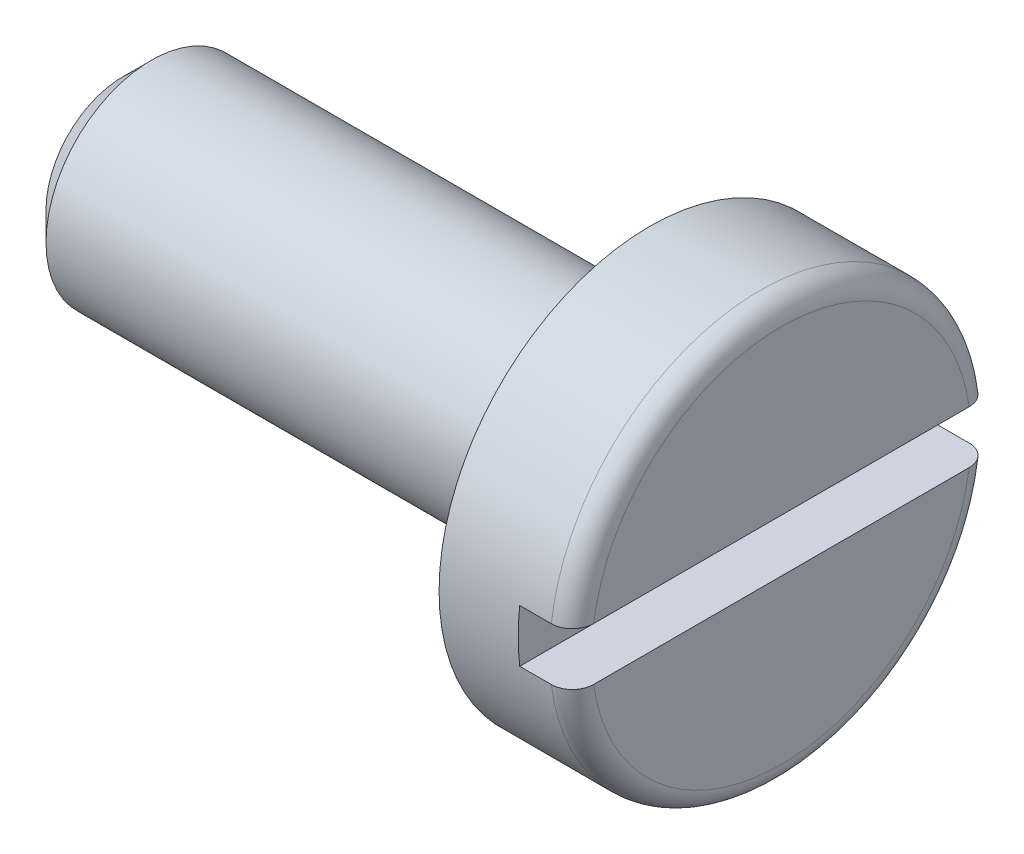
from build123d import *

# Parameters (mm, degrees)
CHANFREIN1_SIZE         = 0.21469
ESQUISSE2_W             = 3.2
ESQUISSE2_H             = 0.4
ENL_V_MAT_EXTRU_1_DEPTH = 0.4


with BuildPart() as part:
    # Esquisse1 → BaseR_volution (revolve)
    with BuildSketch(Plane.XY, mode=Mode.PRIVATE) as baser_volution_sk:
        with BuildLine():
            Line((0, 0), (0, 1.44))
            ThreePointArc((0, 1.44), (-0.046862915, 1.553137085), (-0.16, 1.6))
            Line((-0.16, 1.6), (-1, 1.6))
            Line((-1, 1.6), (-1, 0.8))
            Line((-1, 0.8), (-5, 0.8))
            Line((-5, 0.8), (-5, 0))
            Line((-5, 0), (0, 0))
        make_face()
    revolve(baser_volution_sk.sketch.rotate(Axis((0, 0, 0), (-1, 0, 0)), 90), axis=Axis((0, 0, 0), (-1, 0, 0)))

    # Chanfrein1
    chanfrein1_edges = [part.edges().sort_by_distance(p)[0] for p in [
        (-5, 0, 0.8),
    ]]
    chamfer(chanfrein1_edges, length=CHANFREIN1_SIZE)

    # Esquisse2 → Enl_v. mat.-Extru.1 (cut)
    with BuildSketch(Plane(origin=(0, 0, 0), x_dir=(0, 0, -1), z_dir=(1, 0, 0))):
        Rectangle(ESQUISSE2_W, ESQUISSE2_H)
    extrude(amount=-ENL_V_MAT_EXTRU_1_DEPTH, mode=Mode.SUBTRACT)


solid = part.part
